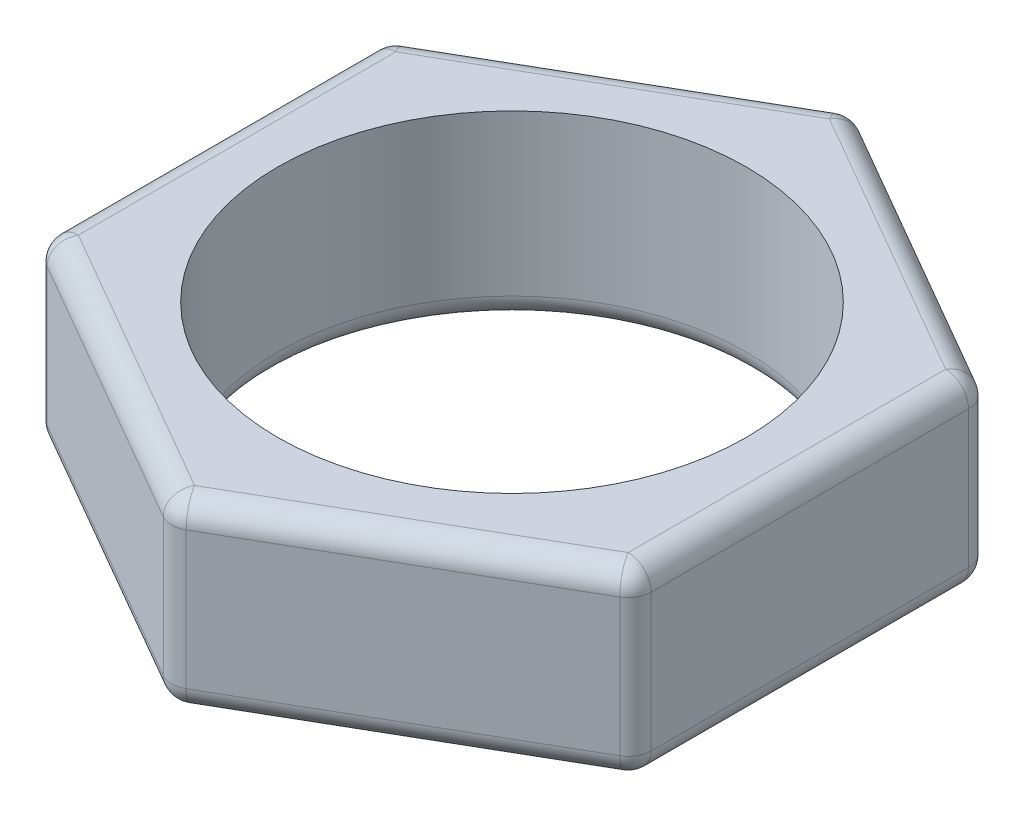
ISO-10303-21;
HEADER;
FILE_DESCRIPTION(('STEP AP214'),'2;1');
FILE_NAME('part.step','',(''),(''),'','','');
FILE_SCHEMA(('AUTOMOTIVE_DESIGN { 1 0 10303 214 1 1 1 1 }'));
ENDSEC;
DATA;
#1=APPLICATION_CONTEXT('core data for automotive mechanical design processes');
#2=APPLICATION_PROTOCOL_DEFINITION('international standard','automotive_design',2000,#1);
#3=PRODUCT_CONTEXT('',#1,'mechanical');
#4=PRODUCT('Part','Part','',(#3));
#5=PRODUCT_RELATED_PRODUCT_CATEGORY('part','',(#4));
#6=PRODUCT_DEFINITION_FORMATION('','',#4);
#7=PRODUCT_DEFINITION_CONTEXT('part definition',#1,'design');
#8=PRODUCT_DEFINITION('design','',#6,#7);
#9=PRODUCT_DEFINITION_SHAPE('','',#8);
#10=(LENGTH_UNIT() NAMED_UNIT(*) SI_UNIT(.MILLI.,.METRE.));
#11=(NAMED_UNIT(*) PLANE_ANGLE_UNIT() SI_UNIT($,.RADIAN.));
#12=(NAMED_UNIT(*) SI_UNIT($,.STERADIAN.) SOLID_ANGLE_UNIT());
#13=UNCERTAINTY_MEASURE_WITH_UNIT(LENGTH_MEASURE(1.E-05),#10,'distance_accuracy_value','');
#14=(GEOMETRIC_REPRESENTATION_CONTEXT(3) GLOBAL_UNCERTAINTY_ASSIGNED_CONTEXT((#13)) GLOBAL_UNIT_ASSIGNED_CONTEXT((#10,
#11,#12)) REPRESENTATION_CONTEXT('',''));
#15=CARTESIAN_POINT('',(0.,0.,0.));
#16=DIRECTION('',(0.,0.,1.));
#17=DIRECTION('',(1.,0.,0.));
#18=AXIS2_PLACEMENT_3D('',#15,#16,#17);
#19=CARTESIAN_POINT('',(0.,4.,0.));
#20=DIRECTION('',(0.,1.,0.));
#21=DIRECTION('',(0.,0.,1.));
#22=AXIS2_PLACEMENT_3D('',#19,#20,#21);
#23=PLANE('',#22);
#24=DIRECTION('',(0.,0.,1.));
#25=VECTOR('',#24,1.);
#26=CARTESIAN_POINT('',(-5.99999999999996,4.,3.75277674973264));
#27=LINE('',#26,#25);
#28=CARTESIAN_POINT('',(-6.00000000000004,4.,-3.46410161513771));
#29=VERTEX_POINT('',#28);
#30=CARTESIAN_POINT('',(-5.99999999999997,4.,3.46410161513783));
#31=VERTEX_POINT('',#30);
#32=EDGE_CURVE('E206',#29,#31,#27,.T.);
#33=ORIENTED_EDGE('',*,*,#32,.T.);
#34=DIRECTION('',(0.866025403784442,0.,0.499999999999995));
#35=VECTOR('',#34,1.);
#36=CARTESIAN_POINT('',(0.249999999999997,4.,7.07254079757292));
#37=LINE('',#36,#35);
#38=CARTESIAN_POINT('',(0.,4.,6.92820323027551));
#39=VERTEX_POINT('',#38);
#40=EDGE_CURVE('E175',#31,#39,#37,.T.);
#41=ORIENTED_EDGE('',*,*,#40,.T.);
#42=DIRECTION('',(0.866025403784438,0.,-0.500000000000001));
#43=VECTOR('',#42,1.);
#44=CARTESIAN_POINT('',(6.25000000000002,4.,3.31976404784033));
#45=LINE('',#44,#43);
#46=CARTESIAN_POINT('',(6.00000000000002,4.,3.46410161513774));
#47=VERTEX_POINT('',#46);
#48=EDGE_CURVE('E194',#39,#47,#45,.T.);
#49=ORIENTED_EDGE('',*,*,#48,.T.);
#50=DIRECTION('',(0.,0.,-1.));
#51=VECTOR('',#50,1.);
#52=CARTESIAN_POINT('',(5.99999999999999,4.,-3.75277674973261));
#53=LINE('',#52,#51);
#54=CARTESIAN_POINT('',(5.99999999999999,4.,-3.46410161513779));
#55=VERTEX_POINT('',#54);
#56=EDGE_CURVE('E201',#47,#55,#53,.T.);
#57=ORIENTED_EDGE('',*,*,#56,.T.);
#58=DIRECTION('',(-0.866025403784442,0.,-0.499999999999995));
#59=VECTOR('',#58,1.);
#60=CARTESIAN_POINT('',(-0.250000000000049,4.,-7.07254079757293));
#61=LINE('',#60,#59);
#62=CARTESIAN_POINT('',(0.,4.,-6.92820323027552));
#63=VERTEX_POINT('',#62);
#64=EDGE_CURVE('E449',#55,#63,#61,.T.);
#65=ORIENTED_EDGE('',*,*,#64,.T.);
#66=DIRECTION('',(-0.866025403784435,0.,0.500000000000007));
#67=VECTOR('',#66,1.);
#68=CARTESIAN_POINT('',(-6.25000000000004,4.,-3.3197640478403));
#69=LINE('',#68,#67);
#70=EDGE_CURVE('E216',#63,#29,#69,.T.);
#71=ORIENTED_EDGE('',*,*,#70,.T.);
#72=EDGE_LOOP('',(#33,#41,#49,#57,#65,#71));
#73=FACE_BOUND('',#72,.T.);
#74=CARTESIAN_POINT('',(0.,4.,0.));
#75=DIRECTION('',(0.,1.,0.));
#76=DIRECTION('',(0.,0.,1.));
#77=AXIS2_PLACEMENT_3D('',#74,#75,#76);
#78=CIRCLE('',#77,5.11350125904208);
#79=CARTESIAN_POINT('',(0.,4.,5.11350125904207));
#80=VERTEX_POINT('',#79);
#81=EDGE_CURVE('E202',#80,#80,#78,.T.);
#82=ORIENTED_EDGE('',*,*,#81,.F.);
#83=EDGE_LOOP('',(#82));
#84=FACE_BOUND('',#83,.T.);
#85=ADVANCED_FACE('F42',(#73,#84),#23,.T.);
#86=CARTESIAN_POINT('',(0.,0.,0.));
#87=DIRECTION('',(0.,1.,0.));
#88=DIRECTION('',(0.,0.,1.));
#89=AXIS2_PLACEMENT_3D('',#86,#87,#88);
#90=PLANE('',#89);
#91=DIRECTION('',(0.866025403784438,0.,-0.500000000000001));
#92=VECTOR('',#91,1.);
#93=CARTESIAN_POINT('',(3.00000000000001,0.,5.19615242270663));
#94=LINE('',#93,#92);
#95=CARTESIAN_POINT('',(6.00000000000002,0.,3.46410161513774));
#96=VERTEX_POINT('',#95);
#97=CARTESIAN_POINT('',(0.,0.,6.92820323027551));
#98=VERTEX_POINT('',#97);
#99=EDGE_CURVE('E231',#96,#98,#94,.F.);
#100=ORIENTED_EDGE('',*,*,#99,.T.);
#101=DIRECTION('',(0.866025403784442,0.,0.499999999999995));
#102=VECTOR('',#101,1.);
#103=CARTESIAN_POINT('',(-2.99999999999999,0.,5.19615242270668));
#104=LINE('',#103,#102);
#105=CARTESIAN_POINT('',(-5.99999999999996,0.,3.46410161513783));
#106=VERTEX_POINT('',#105);
#107=EDGE_CURVE('E246',#98,#106,#104,.F.);
#108=ORIENTED_EDGE('',*,*,#107,.T.);
#109=DIRECTION('',(0.,0.,1.));
#110=VECTOR('',#109,1.);
#111=CARTESIAN_POINT('',(-6.,0.,0.));
#112=LINE('',#111,#110);
#113=CARTESIAN_POINT('',(-6.00000000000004,0.,-3.4641016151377));
#114=VERTEX_POINT('',#113);
#115=EDGE_CURVE('E243',#106,#114,#112,.F.);
#116=ORIENTED_EDGE('',*,*,#115,.T.);
#117=DIRECTION('',(-0.866025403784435,0.,0.500000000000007));
#118=VECTOR('',#117,1.);
#119=CARTESIAN_POINT('',(-3.00000000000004,0.,-5.19615242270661));
#120=LINE('',#119,#118);
#121=CARTESIAN_POINT('',(0.,0.,-6.92820323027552));
#122=VERTEX_POINT('',#121);
#123=EDGE_CURVE('E240',#114,#122,#120,.F.);
#124=ORIENTED_EDGE('',*,*,#123,.T.);
#125=DIRECTION('',(-0.866025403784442,0.,-0.499999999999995));
#126=VECTOR('',#125,1.);
#127=CARTESIAN_POINT('',(2.99999999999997,0.,-5.19615242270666));
#128=LINE('',#127,#126);
#129=CARTESIAN_POINT('',(5.99999999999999,0.,-3.4641016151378));
#130=VERTEX_POINT('',#129);
#131=EDGE_CURVE('E237',#122,#130,#128,.F.);
#132=ORIENTED_EDGE('',*,*,#131,.T.);
#133=DIRECTION('',(0.,0.,-1.));
#134=VECTOR('',#133,1.);
#135=CARTESIAN_POINT('',(6.,0.,0.));
#136=LINE('',#135,#134);
#137=EDGE_CURVE('E234',#130,#96,#136,.F.);
#138=ORIENTED_EDGE('',*,*,#137,.T.);
#139=EDGE_LOOP('',(#100,#108,#116,#124,#132,#138));
#140=FACE_BOUND('',#139,.T.);
#141=CARTESIAN_POINT('',(0.,0.,0.));
#142=DIRECTION('',(0.,1.,0.));
#143=DIRECTION('',(0.,0.,1.));
#144=AXIS2_PLACEMENT_3D('',#141,#142,#143);
#145=CIRCLE('',#144,5.61350125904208);
#146=CARTESIAN_POINT('',(0.,0.,5.61350125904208));
#147=VERTEX_POINT('',#146);
#148=EDGE_CURVE('E227',#147,#147,#145,.T.);
#149=ORIENTED_EDGE('',*,*,#148,.T.);
#150=EDGE_LOOP('',(#149));
#151=FACE_BOUND('',#150,.T.);
#152=ADVANCED_FACE('F540',(#140,#151),#90,.F.);
#153=CARTESIAN_POINT('',(-6.49999999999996,4.,3.75277674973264));
#154=DIRECTION('',(0.499999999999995,0.,-0.866025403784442));
#155=DIRECTION('',(-0.866025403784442,0.,-0.499999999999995));
#156=AXIS2_PLACEMENT_3D('',#153,#154,#155);
#157=PLANE('',#156);
#158=DIRECTION('',(0.866025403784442,0.,0.499999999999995));
#159=VECTOR('',#158,1.);
#160=CARTESIAN_POINT('',(-6.49999999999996,3.5,3.75277674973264));
#161=LINE('',#160,#159);
#162=CARTESIAN_POINT('',(-0.25,3.5,7.36121593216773));
#163=VERTEX_POINT('',#162);
#164=CARTESIAN_POINT('',(-6.24999999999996,3.5,3.89711431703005));
#165=VERTEX_POINT('',#164);
#166=EDGE_CURVE('E177',#163,#165,#161,.F.);
#167=ORIENTED_EDGE('',*,*,#166,.T.);
#168=DIRECTION('',(0.,-1.,0.));
#169=VECTOR('',#168,1.);
#170=CARTESIAN_POINT('',(-6.24999999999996,4.,3.89711431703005));
#171=LINE('',#170,#169);
#172=CARTESIAN_POINT('',(-6.24999999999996,0.5,3.89711431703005));
#173=VERTEX_POINT('',#172);
#174=EDGE_CURVE('E224',#165,#173,#171,.T.);
#175=ORIENTED_EDGE('',*,*,#174,.T.);
#176=DIRECTION('',(0.866025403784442,0.,0.499999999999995));
#177=VECTOR('',#176,1.);
#178=CARTESIAN_POINT('',(-6.49999999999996,0.5,3.75277674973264));
#179=LINE('',#178,#177);
#180=CARTESIAN_POINT('',(-0.25,0.5,7.36121593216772));
#181=VERTEX_POINT('',#180);
#182=EDGE_CURVE('E214',#173,#181,#179,.T.);
#183=ORIENTED_EDGE('',*,*,#182,.T.);
#184=DIRECTION('',(0.,-1.,0.));
#185=VECTOR('',#184,1.);
#186=CARTESIAN_POINT('',(-0.249999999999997,4.,7.36121593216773));
#187=LINE('',#186,#185);
#188=EDGE_CURVE('E209',#181,#163,#187,.F.);
#189=ORIENTED_EDGE('',*,*,#188,.T.);
#190=EDGE_LOOP('',(#167,#175,#183,#189));
#191=FACE_BOUND('',#190,.T.);
#192=ADVANCED_FACE('F479',(#191),#157,.F.);
#193=CARTESIAN_POINT('',(0.,4.,7.50555349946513));
#194=DIRECTION('',(-0.500000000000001,0.,-0.866025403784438));
#195=DIRECTION('',(-0.866025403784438,0.,0.500000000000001));
#196=AXIS2_PLACEMENT_3D('',#193,#194,#195);
#197=PLANE('',#196);
#198=DIRECTION('',(0.866025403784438,0.,-0.500000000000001));
#199=VECTOR('',#198,1.);
#200=CARTESIAN_POINT('',(0.,3.5,7.50555349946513));
#201=LINE('',#200,#199);
#202=CARTESIAN_POINT('',(6.25000000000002,3.5,3.89711431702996));
#203=VERTEX_POINT('',#202);
#204=CARTESIAN_POINT('',(0.25,3.5,7.36121593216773));
#205=VERTEX_POINT('',#204);
#206=EDGE_CURVE('E60',#203,#205,#201,.F.);
#207=ORIENTED_EDGE('',*,*,#206,.T.);
#208=DIRECTION('',(0.,-1.,0.));
#209=VECTOR('',#208,1.);
#210=CARTESIAN_POINT('',(0.25,4.,7.36121593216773));
#211=LINE('',#210,#209);
#212=CARTESIAN_POINT('',(0.25,0.5,7.36121593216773));
#213=VERTEX_POINT('',#212);
#214=EDGE_CURVE('E52',#205,#213,#211,.T.);
#215=ORIENTED_EDGE('',*,*,#214,.T.);
#216=DIRECTION('',(0.866025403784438,0.,-0.500000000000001));
#217=VECTOR('',#216,1.);
#218=CARTESIAN_POINT('',(0.,0.5,7.50555349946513));
#219=LINE('',#218,#217);
#220=CARTESIAN_POINT('',(6.25000000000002,0.5,3.89711431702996));
#221=VERTEX_POINT('',#220);
#222=EDGE_CURVE('E302',#213,#221,#219,.T.);
#223=ORIENTED_EDGE('',*,*,#222,.T.);
#224=DIRECTION('',(0.,-1.,0.));
#225=VECTOR('',#224,1.);
#226=CARTESIAN_POINT('',(6.25000000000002,4.,3.89711431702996));
#227=LINE('',#226,#225);
#228=EDGE_CURVE('E65',#221,#203,#227,.F.);
#229=ORIENTED_EDGE('',*,*,#228,.T.);
#230=EDGE_LOOP('',(#207,#215,#223,#229));
#231=FACE_BOUND('',#230,.T.);
#232=ADVANCED_FACE('F485',(#231),#197,.F.);
#233=CARTESIAN_POINT('',(6.50000000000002,4.,3.75277674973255));
#234=DIRECTION('',(-1.,0.,0.));
#235=DIRECTION('',(0.,0.,1.));
#236=AXIS2_PLACEMENT_3D('',#233,#234,#235);
#237=PLANE('',#236);
#238=DIRECTION('',(0.,-1.,0.));
#239=VECTOR('',#238,1.);
#240=CARTESIAN_POINT('',(6.49999999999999,4.,-3.46410161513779));
#241=LINE('',#240,#239);
#242=CARTESIAN_POINT('',(6.49999999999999,0.5,-3.46410161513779));
#243=VERTEX_POINT('',#242);
#244=CARTESIAN_POINT('',(6.49999999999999,3.5,-3.46410161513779));
#245=VERTEX_POINT('',#244);
#246=EDGE_CURVE('E295',#243,#245,#241,.F.);
#247=ORIENTED_EDGE('',*,*,#246,.T.);
#248=DIRECTION('',(0.,0.,-1.));
#249=VECTOR('',#248,1.);
#250=CARTESIAN_POINT('',(6.50000000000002,3.5,3.75277674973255));
#251=LINE('',#250,#249);
#252=CARTESIAN_POINT('',(6.50000000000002,3.5,3.46410161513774));
#253=VERTEX_POINT('',#252);
#254=EDGE_CURVE('E298',#245,#253,#251,.F.);
#255=ORIENTED_EDGE('',*,*,#254,.T.);
#256=DIRECTION('',(0.,-1.,0.));
#257=VECTOR('',#256,1.);
#258=CARTESIAN_POINT('',(6.50000000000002,4.,3.46410161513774));
#259=LINE('',#258,#257);
#260=CARTESIAN_POINT('',(6.50000000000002,0.5,3.46410161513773));
#261=VERTEX_POINT('',#260);
#262=EDGE_CURVE('E289',#253,#261,#259,.T.);
#263=ORIENTED_EDGE('',*,*,#262,.T.);
#264=DIRECTION('',(0.,0.,-1.));
#265=VECTOR('',#264,1.);
#266=CARTESIAN_POINT('',(6.50000000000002,0.5,3.75277674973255));
#267=LINE('',#266,#265);
#268=EDGE_CURVE('E292',#261,#243,#267,.T.);
#269=ORIENTED_EDGE('',*,*,#268,.T.);
#270=EDGE_LOOP('',(#247,#255,#263,#269));
#271=FACE_BOUND('',#270,.T.);
#272=ADVANCED_FACE('F560',(#271),#237,.F.);
#273=CARTESIAN_POINT('',(6.49999999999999,4.,-3.75277674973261));
#274=DIRECTION('',(-0.499999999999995,0.,0.866025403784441));
#275=DIRECTION('',(0.866025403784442,0.,0.499999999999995));
#276=AXIS2_PLACEMENT_3D('',#273,#274,#275);
#277=PLANE('',#276);
#278=DIRECTION('',(0.,-1.,0.));
#279=VECTOR('',#278,1.);
#280=CARTESIAN_POINT('',(0.249999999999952,4.,-7.36121593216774));
#281=LINE('',#280,#279);
#282=CARTESIAN_POINT('',(0.249999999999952,0.5,-7.36121593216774));
#283=VERTEX_POINT('',#282);
#284=CARTESIAN_POINT('',(0.249999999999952,3.5,-7.36121593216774));
#285=VERTEX_POINT('',#284);
#286=EDGE_CURVE('E282',#283,#285,#281,.F.);
#287=ORIENTED_EDGE('',*,*,#286,.T.);
#288=DIRECTION('',(-0.866025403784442,0.,-0.499999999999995));
#289=VECTOR('',#288,1.);
#290=CARTESIAN_POINT('',(6.49999999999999,3.5,-3.75277674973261));
#291=LINE('',#290,#289);
#292=CARTESIAN_POINT('',(6.24999999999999,3.5,-3.89711431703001));
#293=VERTEX_POINT('',#292);
#294=EDGE_CURVE('E285',#285,#293,#291,.F.);
#295=ORIENTED_EDGE('',*,*,#294,.T.);
#296=DIRECTION('',(0.,-1.,0.));
#297=VECTOR('',#296,1.);
#298=CARTESIAN_POINT('',(6.24999999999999,4.,-3.89711431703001));
#299=LINE('',#298,#297);
#300=CARTESIAN_POINT('',(6.24999999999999,0.5,-3.89711431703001));
#301=VERTEX_POINT('',#300);
#302=EDGE_CURVE('E276',#293,#301,#299,.T.);
#303=ORIENTED_EDGE('',*,*,#302,.T.);
#304=DIRECTION('',(-0.866025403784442,0.,-0.499999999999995));
#305=VECTOR('',#304,1.);
#306=CARTESIAN_POINT('',(6.49999999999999,0.5,-3.75277674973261));
#307=LINE('',#306,#305);
#308=EDGE_CURVE('E279',#301,#283,#307,.T.);
#309=ORIENTED_EDGE('',*,*,#308,.T.);
#310=EDGE_LOOP('',(#287,#295,#303,#309));
#311=FACE_BOUND('',#310,.T.);
#312=ADVANCED_FACE('F520',(#311),#277,.F.);
#313=CARTESIAN_POINT('',(0.,4.,-7.50555349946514));
#314=DIRECTION('',(0.500000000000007,0.,0.866025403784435));
#315=DIRECTION('',(0.866025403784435,0.,-0.500000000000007));
#316=AXIS2_PLACEMENT_3D('',#313,#314,#315);
#317=PLANE('',#316);
#318=DIRECTION('',(0.,-1.,0.));
#319=VECTOR('',#318,1.);
#320=CARTESIAN_POINT('',(-6.25000000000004,4.,-3.89711431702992));
#321=LINE('',#320,#319);
#322=CARTESIAN_POINT('',(-6.25000000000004,0.5,-3.89711431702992));
#323=VERTEX_POINT('',#322);
#324=CARTESIAN_POINT('',(-6.25000000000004,3.5,-3.89711431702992));
#325=VERTEX_POINT('',#324);
#326=EDGE_CURVE('E269',#323,#325,#321,.F.);
#327=ORIENTED_EDGE('',*,*,#326,.T.);
#328=DIRECTION('',(-0.866025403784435,0.,0.500000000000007));
#329=VECTOR('',#328,1.);
#330=CARTESIAN_POINT('',(0.,3.5,-7.50555349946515));
#331=LINE('',#330,#329);
#332=CARTESIAN_POINT('',(-0.250000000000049,3.5,-7.36121593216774));
#333=VERTEX_POINT('',#332);
#334=EDGE_CURVE('E272',#325,#333,#331,.F.);
#335=ORIENTED_EDGE('',*,*,#334,.T.);
#336=DIRECTION('',(0.,-1.,0.));
#337=VECTOR('',#336,1.);
#338=CARTESIAN_POINT('',(-0.250000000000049,4.,-7.36121593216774));
#339=LINE('',#338,#337);
#340=CARTESIAN_POINT('',(-0.250000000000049,0.5,-7.36121593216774));
#341=VERTEX_POINT('',#340);
#342=EDGE_CURVE('E263',#333,#341,#339,.T.);
#343=ORIENTED_EDGE('',*,*,#342,.T.);
#344=DIRECTION('',(-0.866025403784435,0.,0.500000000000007));
#345=VECTOR('',#344,1.);
#346=CARTESIAN_POINT('',(0.,0.5,-7.50555349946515));
#347=LINE('',#346,#345);
#348=EDGE_CURVE('E266',#341,#323,#347,.T.);
#349=ORIENTED_EDGE('',*,*,#348,.T.);
#350=EDGE_LOOP('',(#327,#335,#343,#349));
#351=FACE_BOUND('',#350,.T.);
#352=ADVANCED_FACE('F553',(#351),#317,.F.);
#353=CARTESIAN_POINT('',(-6.50000000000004,4.,-3.75277674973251));
#354=DIRECTION('',(1.,0.,0.));
#355=DIRECTION('',(0.,0.,-1.));
#356=AXIS2_PLACEMENT_3D('',#353,#354,#355);
#357=PLANE('',#356);
#358=DIRECTION('',(0.,-1.,0.));
#359=VECTOR('',#358,1.);
#360=CARTESIAN_POINT('',(-6.49999999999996,4.,3.46410161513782));
#361=LINE('',#360,#359);
#362=CARTESIAN_POINT('',(-6.49999999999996,0.5,3.46410161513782));
#363=VERTEX_POINT('',#362);
#364=CARTESIAN_POINT('',(-6.49999999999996,3.5,3.46410161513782));
#365=VERTEX_POINT('',#364);
#366=EDGE_CURVE('E256',#363,#365,#361,.F.);
#367=ORIENTED_EDGE('',*,*,#366,.T.);
#368=DIRECTION('',(0.,0.,1.));
#369=VECTOR('',#368,1.);
#370=CARTESIAN_POINT('',(-6.50000000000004,3.5,-3.75277674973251));
#371=LINE('',#370,#369);
#372=CARTESIAN_POINT('',(-6.50000000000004,3.5,-3.4641016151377));
#373=VERTEX_POINT('',#372);
#374=EDGE_CURVE('E259',#365,#373,#371,.F.);
#375=ORIENTED_EDGE('',*,*,#374,.T.);
#376=DIRECTION('',(0.,-1.,0.));
#377=VECTOR('',#376,1.);
#378=CARTESIAN_POINT('',(-6.50000000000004,4.,-3.4641016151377));
#379=LINE('',#378,#377);
#380=CARTESIAN_POINT('',(-6.50000000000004,0.5,-3.4641016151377));
#381=VERTEX_POINT('',#380);
#382=EDGE_CURVE('E250',#373,#381,#379,.T.);
#383=ORIENTED_EDGE('',*,*,#382,.T.);
#384=DIRECTION('',(0.,0.,1.));
#385=VECTOR('',#384,1.);
#386=CARTESIAN_POINT('',(-6.50000000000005,0.5,-3.75277674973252));
#387=LINE('',#386,#385);
#388=EDGE_CURVE('E253',#381,#363,#387,.T.);
#389=ORIENTED_EDGE('',*,*,#388,.T.);
#390=EDGE_LOOP('',(#367,#375,#383,#389));
#391=FACE_BOUND('',#390,.T.);
#392=ADVANCED_FACE('F550',(#391),#357,.F.);
#393=CARTESIAN_POINT('',(0.,4.,0.));
#394=DIRECTION('',(0.,-1.,0.));
#395=DIRECTION('',(0.,0.,-1.));
#396=AXIS2_PLACEMENT_3D('',#393,#394,#395);
#397=CYLINDRICAL_SURFACE('',#396,5.11350125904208);
#398=CARTESIAN_POINT('',(0.,0.5,0.));
#399=DIRECTION('',(0.,1.,0.));
#400=DIRECTION('',(0.,0.,1.));
#401=AXIS2_PLACEMENT_3D('',#398,#399,#400);
#402=CIRCLE('',#401,5.11350125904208);
#403=CARTESIAN_POINT('',(0.,0.5,5.11350125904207));
#404=VERTEX_POINT('',#403);
#405=EDGE_CURVE('E11',#404,#404,#402,.F.);
#406=ORIENTED_EDGE('',*,*,#405,.T.);
#407=EDGE_LOOP('',(#406));
#408=FACE_BOUND('',#407,.T.);
#409=ORIENTED_EDGE('',*,*,#81,.T.);
#410=EDGE_LOOP('',(#409));
#411=FACE_BOUND('',#410,.T.);
#412=ADVANCED_FACE('F548',(#408,#411),#397,.F.);
#413=CARTESIAN_POINT('',(6.24999999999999,0.5,-3.31976404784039));
#414=DIRECTION('',(-0.866025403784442,0.,-0.499999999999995));
#415=DIRECTION('',(-0.499999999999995,0.,0.866025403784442));
#416=AXIS2_PLACEMENT_3D('',#413,#414,#415);
#417=CYLINDRICAL_SURFACE('',#416,0.5);
#418=CARTESIAN_POINT('',(0.,0.5,-6.92820323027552));
#419=DIRECTION('',(-0.866025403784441,0.,-0.499999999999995));
#420=DIRECTION('',(-0.499999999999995,0.,0.866025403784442));
#421=AXIS2_PLACEMENT_3D('',#418,#419,#420);
#422=CIRCLE('',#421,0.5);
#423=EDGE_CURVE('E46',#283,#122,#422,.T.);
#424=ORIENTED_EDGE('',*,*,#423,.F.);
#425=ORIENTED_EDGE('',*,*,#308,.F.);
#426=CARTESIAN_POINT('',(5.99999999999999,0.5,-3.4641016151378));
#427=DIRECTION('',(0.866025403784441,0.,0.499999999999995));
#428=DIRECTION('',(0.499999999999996,0.,-0.866025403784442));
#429=AXIS2_PLACEMENT_3D('',#426,#427,#428);
#430=CIRCLE('',#429,0.5);
#431=EDGE_CURVE('E425',#130,#301,#430,.T.);
#432=ORIENTED_EDGE('',*,*,#431,.F.);
#433=ORIENTED_EDGE('',*,*,#131,.F.);
#434=EDGE_LOOP('',(#424,#425,#432,#433));
#435=FACE_BOUND('',#434,.T.);
#436=ADVANCED_FACE('F863',(#435),#417,.T.);
#437=CARTESIAN_POINT('',(0.,0.5,-6.92820323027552));
#438=DIRECTION('',(0.,0.,1.));
#439=DIRECTION('',(1.,0.,0.));
#440=AXIS2_PLACEMENT_3D('',#437,#438,#439);
#441=SPHERICAL_SURFACE('',#440,0.5);
#442=CARTESIAN_POINT('',(0.,0.5,-6.92820323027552));
#443=DIRECTION('',(0.,-1.,0.));
#444=DIRECTION('',(0.,0.,-1.));
#445=AXIS2_PLACEMENT_3D('',#442,#443,#444);
#446=CIRCLE('',#445,0.5);
#447=EDGE_CURVE('E418',#283,#341,#446,.F.);
#448=ORIENTED_EDGE('',*,*,#447,.F.);
#449=ORIENTED_EDGE('',*,*,#423,.T.);
#450=CARTESIAN_POINT('',(0.,0.5,-6.92820323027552));
#451=DIRECTION('',(0.866025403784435,0.,-0.500000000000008));
#452=DIRECTION('',(-0.500000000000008,0.,-0.866025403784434));
#453=AXIS2_PLACEMENT_3D('',#450,#451,#452);
#454=CIRCLE('',#453,0.5);
#455=EDGE_CURVE('E422',#341,#122,#454,.F.);
#456=ORIENTED_EDGE('',*,*,#455,.F.);
#457=EDGE_LOOP('',(#448,#449,#456));
#458=FACE_BOUND('',#457,.T.);
#459=ADVANCED_FACE('F853',(#458),#441,.T.);
#460=CARTESIAN_POINT('',(5.99999999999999,0.5,-3.4641016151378));
#461=DIRECTION('',(0.,0.,1.));
#462=DIRECTION('',(1.,0.,0.));
#463=AXIS2_PLACEMENT_3D('',#460,#461,#462);
#464=SPHERICAL_SURFACE('',#463,0.5);
#465=CARTESIAN_POINT('',(5.99999999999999,0.5,-3.4641016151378));
#466=DIRECTION('',(0.,0.,-1.));
#467=DIRECTION('',(-1.,0.,0.));
#468=AXIS2_PLACEMENT_3D('',#465,#466,#467);
#469=CIRCLE('',#468,0.5);
#470=EDGE_CURVE('E410',#130,#243,#469,.F.);
#471=ORIENTED_EDGE('',*,*,#470,.F.);
#472=ORIENTED_EDGE('',*,*,#431,.T.);
#473=CARTESIAN_POINT('',(5.99999999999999,0.5,-3.4641016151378));
#474=DIRECTION('',(0.,-1.,0.));
#475=DIRECTION('',(0.,0.,-1.));
#476=AXIS2_PLACEMENT_3D('',#473,#474,#475);
#477=CIRCLE('',#476,0.5);
#478=EDGE_CURVE('E414',#243,#301,#477,.F.);
#479=ORIENTED_EDGE('',*,*,#478,.F.);
#480=EDGE_LOOP('',(#471,#472,#479));
#481=FACE_BOUND('',#480,.T.);
#482=ADVANCED_FACE('F842',(#481),#464,.T.);
#483=CARTESIAN_POINT('',(0.249999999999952,0.5,-7.07254079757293));
#484=DIRECTION('',(-0.866025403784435,0.,0.500000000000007));
#485=DIRECTION('',(0.500000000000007,0.,0.866025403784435));
#486=AXIS2_PLACEMENT_3D('',#483,#484,#485);
#487=CYLINDRICAL_SURFACE('',#486,0.5);
#488=ORIENTED_EDGE('',*,*,#455,.T.);
#489=ORIENTED_EDGE('',*,*,#123,.F.);
#490=CARTESIAN_POINT('',(-6.00000000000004,0.5,-3.46410161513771));
#491=DIRECTION('',(-0.866025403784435,0.,0.500000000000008));
#492=DIRECTION('',(0.500000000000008,0.,0.866025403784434));
#493=AXIS2_PLACEMENT_3D('',#490,#491,#492);
#494=CIRCLE('',#493,0.5);
#495=EDGE_CURVE('E406',#323,#114,#494,.T.);
#496=ORIENTED_EDGE('',*,*,#495,.F.);
#497=ORIENTED_EDGE('',*,*,#348,.F.);
#498=EDGE_LOOP('',(#488,#489,#496,#497));
#499=FACE_BOUND('',#498,.T.);
#500=ADVANCED_FACE('F832',(#499),#487,.T.);
#501=CARTESIAN_POINT('',(0.,4.,-6.92820323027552));
#502=DIRECTION('',(0.,-1.,0.));
#503=DIRECTION('',(0.,0.,-1.));
#504=AXIS2_PLACEMENT_3D('',#501,#502,#503);
#505=CYLINDRICAL_SURFACE('',#504,0.5);
#506=ORIENTED_EDGE('',*,*,#447,.T.);
#507=ORIENTED_EDGE('',*,*,#342,.F.);
#508=CARTESIAN_POINT('',(0.,3.5,-6.92820323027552));
#509=DIRECTION('',(0.,1.,0.));
#510=DIRECTION('',(0.,0.,1.));
#511=AXIS2_PLACEMENT_3D('',#508,#509,#510);
#512=CIRCLE('',#511,0.5);
#513=EDGE_CURVE('E402',#285,#333,#512,.T.);
#514=ORIENTED_EDGE('',*,*,#513,.F.);
#515=ORIENTED_EDGE('',*,*,#286,.F.);
#516=EDGE_LOOP('',(#506,#507,#514,#515));
#517=FACE_BOUND('',#516,.T.);
#518=ADVANCED_FACE('F525',(#517),#505,.T.);
#519=CARTESIAN_POINT('',(2.99999999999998,3.5,-5.19615242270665));
#520=DIRECTION('',(0.866025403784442,0.,0.499999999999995));
#521=DIRECTION('',(0.499999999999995,0.,-0.866025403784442));
#522=AXIS2_PLACEMENT_3D('',#519,#520,#521);
#523=CYLINDRICAL_SURFACE('',#522,0.5);
#524=CARTESIAN_POINT('',(5.99999999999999,3.5,-3.4641016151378));
#525=DIRECTION('',(0.866025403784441,0.,0.499999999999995));
#526=DIRECTION('',(0.499999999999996,0.,-0.866025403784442));
#527=AXIS2_PLACEMENT_3D('',#524,#525,#526);
#528=CIRCLE('',#527,0.5);
#529=EDGE_CURVE('E394',#293,#55,#528,.T.);
#530=ORIENTED_EDGE('',*,*,#529,.F.);
#531=ORIENTED_EDGE('',*,*,#294,.F.);
#532=CARTESIAN_POINT('',(0.,3.5,-6.92820323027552));
#533=DIRECTION('',(-0.866025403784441,0.,-0.499999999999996));
#534=DIRECTION('',(-0.499999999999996,0.,0.866025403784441));
#535=AXIS2_PLACEMENT_3D('',#532,#533,#534);
#536=CIRCLE('',#535,0.5);
#537=EDGE_CURVE('E398',#63,#285,#536,.T.);
#538=ORIENTED_EDGE('',*,*,#537,.F.);
#539=ORIENTED_EDGE('',*,*,#64,.F.);
#540=EDGE_LOOP('',(#530,#531,#538,#539));
#541=FACE_BOUND('',#540,.T.);
#542=ADVANCED_FACE('F508',(#541),#523,.T.);
#543=CARTESIAN_POINT('',(5.99999999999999,4.,-3.4641016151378));
#544=DIRECTION('',(0.,-1.,0.));
#545=DIRECTION('',(0.,0.,-1.));
#546=AXIS2_PLACEMENT_3D('',#543,#544,#545);
#547=CYLINDRICAL_SURFACE('',#546,0.5);
#548=ORIENTED_EDGE('',*,*,#478,.T.);
#549=ORIENTED_EDGE('',*,*,#302,.F.);
#550=CARTESIAN_POINT('',(5.99999999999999,3.5,-3.4641016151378));
#551=DIRECTION('',(0.,1.,0.));
#552=DIRECTION('',(0.,0.,1.));
#553=AXIS2_PLACEMENT_3D('',#550,#551,#552);
#554=CIRCLE('',#553,0.5);
#555=EDGE_CURVE('E391',#245,#293,#554,.T.);
#556=ORIENTED_EDGE('',*,*,#555,.F.);
#557=ORIENTED_EDGE('',*,*,#246,.F.);
#558=EDGE_LOOP('',(#548,#549,#556,#557));
#559=FACE_BOUND('',#558,.T.);
#560=ADVANCED_FACE('F517',(#559),#547,.T.);
#561=CARTESIAN_POINT('',(6.00000000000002,0.5,3.75277674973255));
#562=DIRECTION('',(0.,0.,-1.));
#563=DIRECTION('',(-1.,0.,0.));
#564=AXIS2_PLACEMENT_3D('',#561,#562,#563);
#565=CYLINDRICAL_SURFACE('',#564,0.5);
#566=ORIENTED_EDGE('',*,*,#470,.T.);
#567=ORIENTED_EDGE('',*,*,#268,.F.);
#568=CARTESIAN_POINT('',(6.00000000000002,0.5,3.46410161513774));
#569=DIRECTION('',(0.,0.,1.));
#570=DIRECTION('',(1.,0.,0.));
#571=AXIS2_PLACEMENT_3D('',#568,#569,#570);
#572=CIRCLE('',#571,0.5);
#573=EDGE_CURVE('E387',#96,#261,#572,.T.);
#574=ORIENTED_EDGE('',*,*,#573,.F.);
#575=ORIENTED_EDGE('',*,*,#137,.F.);
#576=EDGE_LOOP('',(#566,#567,#574,#575));
#577=FACE_BOUND('',#576,.T.);
#578=ADVANCED_FACE('F536',(#577),#565,.T.);
#579=CARTESIAN_POINT('',(-6.00000000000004,0.5,-3.46410161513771));
#580=DIRECTION('',(0.,0.,1.));
#581=DIRECTION('',(1.,0.,0.));
#582=AXIS2_PLACEMENT_3D('',#579,#580,#581);
#583=SPHERICAL_SURFACE('',#582,0.5);
#584=CARTESIAN_POINT('',(-6.00000000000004,0.5,-3.46410161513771));
#585=DIRECTION('',(0.,-1.,0.));
#586=DIRECTION('',(0.,0.,-1.));
#587=AXIS2_PLACEMENT_3D('',#584,#585,#586);
#588=CIRCLE('',#587,0.5);
#589=EDGE_CURVE('E379',#323,#381,#588,.F.);
#590=ORIENTED_EDGE('',*,*,#589,.F.);
#591=ORIENTED_EDGE('',*,*,#495,.T.);
#592=CARTESIAN_POINT('',(-6.00000000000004,0.5,-3.46410161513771));
#593=DIRECTION('',(0.,0.,-1.));
#594=DIRECTION('',(-1.,0.,0.));
#595=AXIS2_PLACEMENT_3D('',#592,#593,#594);
#596=CIRCLE('',#595,0.5);
#597=EDGE_CURVE('E383',#381,#114,#596,.F.);
#598=ORIENTED_EDGE('',*,*,#597,.F.);
#599=EDGE_LOOP('',(#590,#591,#598));
#600=FACE_BOUND('',#599,.T.);
#601=ADVANCED_FACE('F529',(#600),#583,.T.);
#602=CARTESIAN_POINT('',(0.,3.5,-6.92820323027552));
#603=DIRECTION('',(0.,0.,1.));
#604=DIRECTION('',(1.,0.,0.));
#605=AXIS2_PLACEMENT_3D('',#602,#603,#604);
#606=SPHERICAL_SURFACE('',#605,0.5);
#607=ORIENTED_EDGE('',*,*,#537,.T.);
#608=ORIENTED_EDGE('',*,*,#513,.T.);
#609=CARTESIAN_POINT('',(0.,3.5,-6.92820323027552));
#610=DIRECTION('',(0.866025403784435,0.,-0.500000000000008));
#611=DIRECTION('',(-0.500000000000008,0.,-0.866025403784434));
#612=AXIS2_PLACEMENT_3D('',#609,#610,#611);
#613=CIRCLE('',#612,0.5);
#614=EDGE_CURVE('E376',#63,#333,#613,.F.);
#615=ORIENTED_EDGE('',*,*,#614,.F.);
#616=EDGE_LOOP('',(#607,#608,#615));
#617=FACE_BOUND('',#616,.T.);
#618=ADVANCED_FACE('F527',(#617),#606,.T.);
#619=CARTESIAN_POINT('',(5.99999999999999,3.5,-3.4641016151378));
#620=DIRECTION('',(0.,0.,1.));
#621=DIRECTION('',(1.,0.,0.));
#622=AXIS2_PLACEMENT_3D('',#619,#620,#621);
#623=SPHERICAL_SURFACE('',#622,0.5);
#624=ORIENTED_EDGE('',*,*,#555,.T.);
#625=ORIENTED_EDGE('',*,*,#529,.T.);
#626=CARTESIAN_POINT('',(5.99999999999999,3.5,-3.46410161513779));
#627=DIRECTION('',(0.,0.,-1.));
#628=DIRECTION('',(-1.,0.,0.));
#629=AXIS2_PLACEMENT_3D('',#626,#627,#628);
#630=CIRCLE('',#629,0.5);
#631=EDGE_CURVE('E372',#245,#55,#630,.F.);
#632=ORIENTED_EDGE('',*,*,#631,.F.);
#633=EDGE_LOOP('',(#624,#625,#632));
#634=FACE_BOUND('',#633,.T.);
#635=ADVANCED_FACE('F513',(#634),#623,.T.);
#636=CARTESIAN_POINT('',(6.00000000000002,0.5,3.46410161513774));
#637=DIRECTION('',(0.,0.,1.));
#638=DIRECTION('',(1.,0.,0.));
#639=AXIS2_PLACEMENT_3D('',#636,#637,#638);
#640=SPHERICAL_SURFACE('',#639,0.5);
#641=CARTESIAN_POINT('',(6.00000000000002,0.5,3.46410161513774));
#642=DIRECTION('',(0.866025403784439,0.,-0.500000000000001));
#643=DIRECTION('',(-0.5,0.,-0.866025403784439));
#644=AXIS2_PLACEMENT_3D('',#641,#642,#643);
#645=CIRCLE('',#644,0.5);
#646=EDGE_CURVE('E364',#96,#221,#645,.F.);
#647=ORIENTED_EDGE('',*,*,#646,.F.);
#648=ORIENTED_EDGE('',*,*,#573,.T.);
#649=CARTESIAN_POINT('',(6.00000000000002,0.5,3.46410161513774));
#650=DIRECTION('',(0.,-1.,0.));
#651=DIRECTION('',(0.,0.,-1.));
#652=AXIS2_PLACEMENT_3D('',#649,#650,#651);
#653=CIRCLE('',#652,0.5);
#654=EDGE_CURVE('E368',#221,#261,#653,.F.);
#655=ORIENTED_EDGE('',*,*,#654,.F.);
#656=EDGE_LOOP('',(#647,#648,#655));
#657=FACE_BOUND('',#656,.T.);
#658=ADVANCED_FACE('F494',(#657),#640,.T.);
#659=CARTESIAN_POINT('',(-6.00000000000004,0.5,-3.75277674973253));
#660=DIRECTION('',(0.,0.,1.));
#661=DIRECTION('',(1.,0.,0.));
#662=AXIS2_PLACEMENT_3D('',#659,#660,#661);
#663=CYLINDRICAL_SURFACE('',#662,0.5);
#664=ORIENTED_EDGE('',*,*,#597,.T.);
#665=ORIENTED_EDGE('',*,*,#115,.F.);
#666=CARTESIAN_POINT('',(-5.99999999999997,0.5,3.46410161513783));
#667=DIRECTION('',(0.,0.,1.));
#668=DIRECTION('',(1.,0.,0.));
#669=AXIS2_PLACEMENT_3D('',#666,#667,#668);
#670=CIRCLE('',#669,0.5);
#671=EDGE_CURVE('E357',#363,#106,#670,.T.);
#672=ORIENTED_EDGE('',*,*,#671,.F.);
#673=ORIENTED_EDGE('',*,*,#388,.F.);
#674=EDGE_LOOP('',(#664,#665,#672,#673));
#675=FACE_BOUND('',#674,.T.);
#676=ADVANCED_FACE('F609',(#675),#663,.T.);
#677=CARTESIAN_POINT('',(-6.00000000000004,4.,-3.46410161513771));
#678=DIRECTION('',(0.,-1.,0.));
#679=DIRECTION('',(0.,0.,-1.));
#680=AXIS2_PLACEMENT_3D('',#677,#678,#679);
#681=CYLINDRICAL_SURFACE('',#680,0.5);
#682=ORIENTED_EDGE('',*,*,#589,.T.);
#683=ORIENTED_EDGE('',*,*,#382,.F.);
#684=CARTESIAN_POINT('',(-6.00000000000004,3.5,-3.46410161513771));
#685=DIRECTION('',(0.,1.,0.));
#686=DIRECTION('',(0.,0.,1.));
#687=AXIS2_PLACEMENT_3D('',#684,#685,#686);
#688=CIRCLE('',#687,0.5);
#689=EDGE_CURVE('E353',#325,#373,#688,.T.);
#690=ORIENTED_EDGE('',*,*,#689,.F.);
#691=ORIENTED_EDGE('',*,*,#326,.F.);
#692=EDGE_LOOP('',(#682,#683,#690,#691));
#693=FACE_BOUND('',#692,.T.);
#694=ADVANCED_FACE('F606',(#693),#681,.T.);
#695=CARTESIAN_POINT('',(-3.00000000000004,3.5,-5.19615242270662));
#696=DIRECTION('',(0.866025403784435,0.,-0.500000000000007));
#697=DIRECTION('',(-0.500000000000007,0.,-0.866025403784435));
#698=AXIS2_PLACEMENT_3D('',#695,#696,#697);
#699=CYLINDRICAL_SURFACE('',#698,0.5);
#700=ORIENTED_EDGE('',*,*,#614,.T.);
#701=ORIENTED_EDGE('',*,*,#334,.F.);
#702=CARTESIAN_POINT('',(-6.00000000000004,3.5,-3.46410161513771));
#703=DIRECTION('',(-0.866025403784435,0.,0.500000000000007));
#704=DIRECTION('',(0.500000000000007,0.,0.866025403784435));
#705=AXIS2_PLACEMENT_3D('',#702,#703,#704);
#706=CIRCLE('',#705,0.5);
#707=EDGE_CURVE('E349',#29,#325,#706,.T.);
#708=ORIENTED_EDGE('',*,*,#707,.F.);
#709=ORIENTED_EDGE('',*,*,#70,.F.);
#710=EDGE_LOOP('',(#700,#701,#708,#709));
#711=FACE_BOUND('',#710,.T.);
#712=ADVANCED_FACE('F460',(#711),#699,.T.);
#713=CARTESIAN_POINT('',(6.00000000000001,3.5,0.));
#714=DIRECTION('',(0.,0.,1.));
#715=DIRECTION('',(1.,0.,0.));
#716=AXIS2_PLACEMENT_3D('',#713,#714,#715);
#717=CYLINDRICAL_SURFACE('',#716,0.5);
#718=ORIENTED_EDGE('',*,*,#631,.T.);
#719=ORIENTED_EDGE('',*,*,#56,.F.);
#720=CARTESIAN_POINT('',(6.00000000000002,3.5,3.46410161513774));
#721=DIRECTION('',(0.,0.,1.));
#722=DIRECTION('',(1.,0.,0.));
#723=AXIS2_PLACEMENT_3D('',#720,#721,#722);
#724=CIRCLE('',#723,0.5);
#725=EDGE_CURVE('E345',#253,#47,#724,.T.);
#726=ORIENTED_EDGE('',*,*,#725,.F.);
#727=ORIENTED_EDGE('',*,*,#254,.F.);
#728=EDGE_LOOP('',(#718,#719,#726,#727));
#729=FACE_BOUND('',#728,.T.);
#730=ADVANCED_FACE('F504',(#729),#717,.T.);
#731=CARTESIAN_POINT('',(6.00000000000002,4.,3.46410161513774));
#732=DIRECTION('',(0.,-1.,0.));
#733=DIRECTION('',(0.,0.,-1.));
#734=AXIS2_PLACEMENT_3D('',#731,#732,#733);
#735=CYLINDRICAL_SURFACE('',#734,0.5);
#736=ORIENTED_EDGE('',*,*,#654,.T.);
#737=ORIENTED_EDGE('',*,*,#262,.F.);
#738=CARTESIAN_POINT('',(6.00000000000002,3.5,3.46410161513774));
#739=DIRECTION('',(0.,1.,0.));
#740=DIRECTION('',(0.,0.,1.));
#741=AXIS2_PLACEMENT_3D('',#738,#739,#740);
#742=CIRCLE('',#741,0.5);
#743=EDGE_CURVE('E342',#203,#253,#742,.T.);
#744=ORIENTED_EDGE('',*,*,#743,.F.);
#745=ORIENTED_EDGE('',*,*,#228,.F.);
#746=EDGE_LOOP('',(#736,#737,#744,#745));
#747=FACE_BOUND('',#746,.T.);
#748=ADVANCED_FACE('F498',(#747),#735,.T.);
#749=CARTESIAN_POINT('',(-0.25,0.5,7.07254079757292));
#750=DIRECTION('',(0.866025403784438,0.,-0.500000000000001));
#751=DIRECTION('',(-0.500000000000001,0.,-0.866025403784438));
#752=AXIS2_PLACEMENT_3D('',#749,#750,#751);
#753=CYLINDRICAL_SURFACE('',#752,0.5);
#754=ORIENTED_EDGE('',*,*,#646,.T.);
#755=ORIENTED_EDGE('',*,*,#222,.F.);
#756=CARTESIAN_POINT('',(0.,0.5,6.92820323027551));
#757=DIRECTION('',(-0.866025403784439,0.,0.500000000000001));
#758=DIRECTION('',(0.500000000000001,0.,0.866025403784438));
#759=AXIS2_PLACEMENT_3D('',#756,#757,#758);
#760=CIRCLE('',#759,0.5);
#761=EDGE_CURVE('E338',#98,#213,#760,.T.);
#762=ORIENTED_EDGE('',*,*,#761,.F.);
#763=ORIENTED_EDGE('',*,*,#99,.F.);
#764=EDGE_LOOP('',(#754,#755,#762,#763));
#765=FACE_BOUND('',#764,.T.);
#766=ADVANCED_FACE('F492',(#765),#753,.T.);
#767=CARTESIAN_POINT('',(-6.24999999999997,0.5,3.31976404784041));
#768=DIRECTION('',(0.866025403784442,0.,0.499999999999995));
#769=DIRECTION('',(0.499999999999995,0.,-0.866025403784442));
#770=AXIS2_PLACEMENT_3D('',#767,#768,#769);
#771=CYLINDRICAL_SURFACE('',#770,0.5);
#772=CARTESIAN_POINT('',(-5.99999999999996,0.5,3.46410161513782));
#773=DIRECTION('',(-0.866025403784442,0.,-0.499999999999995));
#774=DIRECTION('',(-0.499999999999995,0.,0.866025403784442));
#775=AXIS2_PLACEMENT_3D('',#772,#773,#774);
#776=CIRCLE('',#775,0.5);
#777=EDGE_CURVE('E360',#106,#173,#776,.T.);
#778=ORIENTED_EDGE('',*,*,#777,.F.);
#779=ORIENTED_EDGE('',*,*,#107,.F.);
#780=CARTESIAN_POINT('',(0.,0.5,6.92820323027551));
#781=DIRECTION('',(0.866025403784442,0.,0.499999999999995));
#782=DIRECTION('',(0.499999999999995,0.,-0.866025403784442));
#783=AXIS2_PLACEMENT_3D('',#780,#781,#782);
#784=CIRCLE('',#783,0.5);
#785=EDGE_CURVE('E334',#181,#98,#784,.T.);
#786=ORIENTED_EDGE('',*,*,#785,.F.);
#787=ORIENTED_EDGE('',*,*,#182,.F.);
#788=EDGE_LOOP('',(#778,#779,#786,#787));
#789=FACE_BOUND('',#788,.T.);
#790=ADVANCED_FACE('F593',(#789),#771,.T.);
#791=CARTESIAN_POINT('',(-5.99999999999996,0.5,3.46410161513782));
#792=DIRECTION('',(0.,0.,1.));
#793=DIRECTION('',(1.,0.,0.));
#794=AXIS2_PLACEMENT_3D('',#791,#792,#793);
#795=SPHERICAL_SURFACE('',#794,0.5);
#796=ORIENTED_EDGE('',*,*,#671,.T.);
#797=ORIENTED_EDGE('',*,*,#777,.T.);
#798=CARTESIAN_POINT('',(-5.99999999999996,0.5,3.46410161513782));
#799=DIRECTION('',(0.,-1.,0.));
#800=DIRECTION('',(0.,0.,-1.));
#801=AXIS2_PLACEMENT_3D('',#798,#799,#800);
#802=CIRCLE('',#801,0.5);
#803=EDGE_CURVE('E330',#363,#173,#802,.F.);
#804=ORIENTED_EDGE('',*,*,#803,.F.);
#805=EDGE_LOOP('',(#796,#797,#804));
#806=FACE_BOUND('',#805,.T.);
#807=ADVANCED_FACE('F590',(#806),#795,.T.);
#808=CARTESIAN_POINT('',(-6.00000000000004,3.5,-3.46410161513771));
#809=DIRECTION('',(0.,0.,1.));
#810=DIRECTION('',(1.,0.,0.));
#811=AXIS2_PLACEMENT_3D('',#808,#809,#810);
#812=SPHERICAL_SURFACE('',#811,0.5);
#813=ORIENTED_EDGE('',*,*,#707,.T.);
#814=ORIENTED_EDGE('',*,*,#689,.T.);
#815=CARTESIAN_POINT('',(-6.00000000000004,3.5,-3.46410161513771));
#816=DIRECTION('',(0.,0.,-1.));
#817=DIRECTION('',(-1.,0.,0.));
#818=AXIS2_PLACEMENT_3D('',#815,#816,#817);
#819=CIRCLE('',#818,0.5);
#820=EDGE_CURVE('E327',#29,#373,#819,.F.);
#821=ORIENTED_EDGE('',*,*,#820,.F.);
#822=EDGE_LOOP('',(#813,#814,#821));
#823=FACE_BOUND('',#822,.T.);
#824=ADVANCED_FACE('F463',(#823),#812,.T.);
#825=CARTESIAN_POINT('',(6.00000000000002,3.5,3.46410161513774));
#826=DIRECTION('',(0.,0.,1.));
#827=DIRECTION('',(1.,0.,0.));
#828=AXIS2_PLACEMENT_3D('',#825,#826,#827);
#829=SPHERICAL_SURFACE('',#828,0.5);
#830=ORIENTED_EDGE('',*,*,#743,.T.);
#831=ORIENTED_EDGE('',*,*,#725,.T.);
#832=CARTESIAN_POINT('',(6.00000000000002,3.5,3.46410161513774));
#833=DIRECTION('',(0.86602540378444,0.,-0.499999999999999));
#834=DIRECTION('',(-0.499999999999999,0.,-0.866025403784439));
#835=AXIS2_PLACEMENT_3D('',#832,#833,#834);
#836=CIRCLE('',#835,0.5);
#837=EDGE_CURVE('E197',#203,#47,#836,.F.);
#838=ORIENTED_EDGE('',*,*,#837,.F.);
#839=EDGE_LOOP('',(#830,#831,#838));
#840=FACE_BOUND('',#839,.T.);
#841=ADVANCED_FACE('F501',(#840),#829,.T.);
#842=CARTESIAN_POINT('',(0.,0.5,6.92820323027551));
#843=DIRECTION('',(0.,0.,1.));
#844=DIRECTION('',(1.,0.,0.));
#845=AXIS2_PLACEMENT_3D('',#842,#843,#844);
#846=SPHERICAL_SURFACE('',#845,0.5);
#847=ORIENTED_EDGE('',*,*,#785,.T.);
#848=ORIENTED_EDGE('',*,*,#761,.T.);
#849=CARTESIAN_POINT('',(0.,0.5,6.92820323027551));
#850=DIRECTION('',(0.,-1.,0.));
#851=DIRECTION('',(0.,0.,-1.));
#852=AXIS2_PLACEMENT_3D('',#849,#850,#851);
#853=CIRCLE('',#852,0.5);
#854=EDGE_CURVE('E322',#181,#213,#853,.F.);
#855=ORIENTED_EDGE('',*,*,#854,.F.);
#856=EDGE_LOOP('',(#847,#848,#855));
#857=FACE_BOUND('',#856,.T.);
#858=ADVANCED_FACE('F582',(#857),#846,.T.);
#859=CARTESIAN_POINT('',(-5.99999999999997,4.,3.46410161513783));
#860=DIRECTION('',(0.,-1.,0.));
#861=DIRECTION('',(0.,0.,-1.));
#862=AXIS2_PLACEMENT_3D('',#859,#860,#861);
#863=CYLINDRICAL_SURFACE('',#862,0.5);
#864=ORIENTED_EDGE('',*,*,#803,.T.);
#865=ORIENTED_EDGE('',*,*,#174,.F.);
#866=CARTESIAN_POINT('',(-5.99999999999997,3.5,3.46410161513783));
#867=DIRECTION('',(0.,1.,0.));
#868=DIRECTION('',(0.,0.,1.));
#869=AXIS2_PLACEMENT_3D('',#866,#867,#868);
#870=CIRCLE('',#869,0.5);
#871=EDGE_CURVE('E318',#365,#165,#870,.T.);
#872=ORIENTED_EDGE('',*,*,#871,.F.);
#873=ORIENTED_EDGE('',*,*,#366,.F.);
#874=EDGE_LOOP('',(#864,#865,#872,#873));
#875=FACE_BOUND('',#874,.T.);
#876=ADVANCED_FACE('F475',(#875),#863,.T.);
#877=CARTESIAN_POINT('',(-6.,3.5,0.));
#878=DIRECTION('',(0.,0.,-1.));
#879=DIRECTION('',(-1.,0.,0.));
#880=AXIS2_PLACEMENT_3D('',#877,#878,#879);
#881=CYLINDRICAL_SURFACE('',#880,0.5);
#882=ORIENTED_EDGE('',*,*,#820,.T.);
#883=ORIENTED_EDGE('',*,*,#374,.F.);
#884=CARTESIAN_POINT('',(-5.99999999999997,3.5,3.46410161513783));
#885=DIRECTION('',(0.,0.,1.));
#886=DIRECTION('',(1.,0.,0.));
#887=AXIS2_PLACEMENT_3D('',#884,#885,#886);
#888=CIRCLE('',#887,0.5);
#889=EDGE_CURVE('E191',#31,#365,#888,.T.);
#890=ORIENTED_EDGE('',*,*,#889,.F.);
#891=ORIENTED_EDGE('',*,*,#32,.F.);
#892=EDGE_LOOP('',(#882,#883,#890,#891));
#893=FACE_BOUND('',#892,.T.);
#894=ADVANCED_FACE('F467',(#893),#881,.T.);
#895=CARTESIAN_POINT('',(3.00000000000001,3.5,5.19615242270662));
#896=DIRECTION('',(-0.866025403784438,0.,0.500000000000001));
#897=DIRECTION('',(0.500000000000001,0.,0.866025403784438));
#898=AXIS2_PLACEMENT_3D('',#895,#896,#897);
#899=CYLINDRICAL_SURFACE('',#898,0.5);
#900=ORIENTED_EDGE('',*,*,#837,.T.);
#901=ORIENTED_EDGE('',*,*,#48,.F.);
#902=CARTESIAN_POINT('',(0.,3.5,6.92820323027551));
#903=DIRECTION('',(-0.866025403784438,0.,0.500000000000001));
#904=DIRECTION('',(0.500000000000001,0.,0.866025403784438));
#905=AXIS2_PLACEMENT_3D('',#902,#903,#904);
#906=CIRCLE('',#905,0.5);
#907=EDGE_CURVE('E184',#205,#39,#906,.T.);
#908=ORIENTED_EDGE('',*,*,#907,.F.);
#909=ORIENTED_EDGE('',*,*,#206,.F.);
#910=EDGE_LOOP('',(#900,#901,#908,#909));
#911=FACE_BOUND('',#910,.T.);
#912=ADVANCED_FACE('F195',(#911),#899,.T.);
#913=CARTESIAN_POINT('',(0.,4.,6.92820323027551));
#914=DIRECTION('',(0.,-1.,0.));
#915=DIRECTION('',(0.,0.,-1.));
#916=AXIS2_PLACEMENT_3D('',#913,#914,#915);
#917=CYLINDRICAL_SURFACE('',#916,0.5);
#918=ORIENTED_EDGE('',*,*,#854,.T.);
#919=ORIENTED_EDGE('',*,*,#214,.F.);
#920=CARTESIAN_POINT('',(0.,3.5,6.92820323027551));
#921=DIRECTION('',(0.,1.,0.));
#922=DIRECTION('',(0.,0.,1.));
#923=AXIS2_PLACEMENT_3D('',#920,#921,#922);
#924=CIRCLE('',#923,0.5);
#925=EDGE_CURVE('E188',#163,#205,#924,.T.);
#926=ORIENTED_EDGE('',*,*,#925,.F.);
#927=ORIENTED_EDGE('',*,*,#188,.F.);
#928=EDGE_LOOP('',(#918,#919,#926,#927));
#929=FACE_BOUND('',#928,.T.);
#930=ADVANCED_FACE('F483',(#929),#917,.T.);
#931=CARTESIAN_POINT('',(-5.99999999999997,3.5,3.46410161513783));
#932=DIRECTION('',(0.,0.,1.));
#933=DIRECTION('',(1.,0.,0.));
#934=AXIS2_PLACEMENT_3D('',#931,#932,#933);
#935=SPHERICAL_SURFACE('',#934,0.5);
#936=ORIENTED_EDGE('',*,*,#889,.T.);
#937=ORIENTED_EDGE('',*,*,#871,.T.);
#938=CARTESIAN_POINT('',(-5.99999999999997,3.5,3.46410161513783));
#939=DIRECTION('',(-0.866025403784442,0.,-0.499999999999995));
#940=DIRECTION('',(-0.499999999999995,0.,0.866025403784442));
#941=AXIS2_PLACEMENT_3D('',#938,#939,#940);
#942=CIRCLE('',#941,0.5);
#943=EDGE_CURVE('E181',#31,#165,#942,.F.);
#944=ORIENTED_EDGE('',*,*,#943,.F.);
#945=EDGE_LOOP('',(#936,#937,#944));
#946=FACE_BOUND('',#945,.T.);
#947=ADVANCED_FACE('F471',(#946),#935,.T.);
#948=CARTESIAN_POINT('',(0.,3.5,6.92820323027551));
#949=DIRECTION('',(0.,0.,1.));
#950=DIRECTION('',(1.,0.,0.));
#951=AXIS2_PLACEMENT_3D('',#948,#949,#950);
#952=SPHERICAL_SURFACE('',#951,0.5);
#953=ORIENTED_EDGE('',*,*,#925,.T.);
#954=ORIENTED_EDGE('',*,*,#907,.T.);
#955=CARTESIAN_POINT('',(0.,3.5,6.92820323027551));
#956=DIRECTION('',(0.866025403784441,0.,0.499999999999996));
#957=DIRECTION('',(0.499999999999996,0.,-0.866025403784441));
#958=AXIS2_PLACEMENT_3D('',#955,#956,#957);
#959=CIRCLE('',#958,0.5);
#960=EDGE_CURVE('E171',#163,#39,#959,.F.);
#961=ORIENTED_EDGE('',*,*,#960,.F.);
#962=EDGE_LOOP('',(#953,#954,#961));
#963=FACE_BOUND('',#962,.T.);
#964=ADVANCED_FACE('F186',(#963),#952,.T.);
#965=CARTESIAN_POINT('',(-2.99999999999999,3.5,5.19615242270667));
#966=DIRECTION('',(-0.866025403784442,0.,-0.499999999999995));
#967=DIRECTION('',(-0.499999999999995,0.,0.866025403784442));
#968=AXIS2_PLACEMENT_3D('',#965,#966,#967);
#969=CYLINDRICAL_SURFACE('',#968,0.5);
#970=ORIENTED_EDGE('',*,*,#943,.T.);
#971=ORIENTED_EDGE('',*,*,#166,.F.);
#972=ORIENTED_EDGE('',*,*,#960,.T.);
#973=ORIENTED_EDGE('',*,*,#40,.F.);
#974=EDGE_LOOP('',(#970,#971,#972,#973));
#975=FACE_BOUND('',#974,.T.);
#976=ADVANCED_FACE('F173',(#975),#969,.T.);
#977=CARTESIAN_POINT('',(0.,0.5,0.));
#978=DIRECTION('',(0.,1.,0.));
#979=DIRECTION('',(0.,0.,1.));
#980=AXIS2_PLACEMENT_3D('',#977,#978,#979);
#981=TOROIDAL_SURFACE('',#980,5.61350125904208,0.5);
#982=ORIENTED_EDGE('',*,*,#405,.F.);
#983=EDGE_LOOP('',(#982));
#984=FACE_BOUND('',#983,.T.);
#985=ORIENTED_EDGE('',*,*,#148,.F.);
#986=EDGE_LOOP('',(#985));
#987=FACE_BOUND('',#986,.T.);
#988=ADVANCED_FACE('F44',(#984,#987),#981,.T.);
#989=CLOSED_SHELL('',(#85,#152,#192,#232,#272,#312,#352,#392,#412,#436,#459,#482,#500,#518,#542,
#560,#578,#601,#618,#635,#658,#676,#694,#712,#730,#748,#766,#790,#807,#824,#841,#858,#876,#894,
#912,#930,#947,#964,#976,#988));
#990=MANIFOLD_SOLID_BREP('B2',#989);
#991=ADVANCED_BREP_SHAPE_REPRESENTATION('',(#18,#990),#14);
#992=SHAPE_DEFINITION_REPRESENTATION(#9,#991);
ENDSEC;
END-ISO-10303-21;
